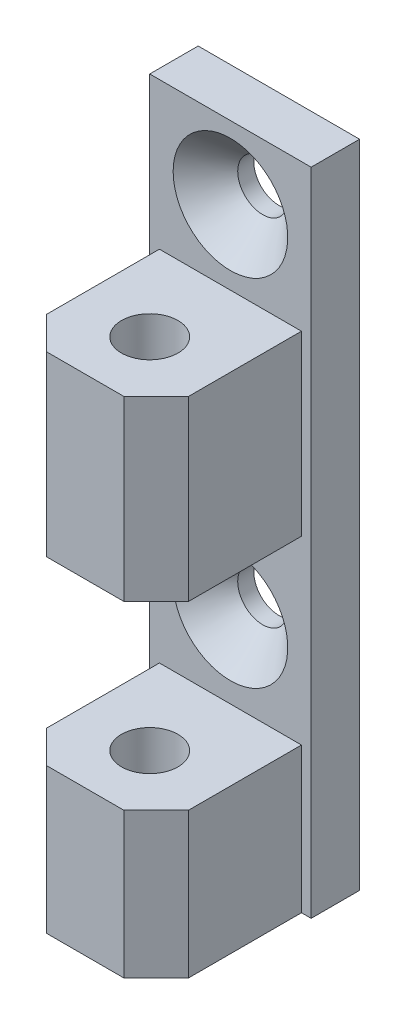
from build123d import *

# Parameters (mm, degrees)
ESQUISSE1_W             = 10
ESQUISSE1_H             = 12
EXTRUSION1_DEPTH        = 40.3
ESQUISSE2_R             = 1.75
ENL_V_MAT_EXTRU_1_DEPTH = 40.6
ESQUISSE3_W             = 10.281492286
ESQUISSE3_H             = 9.1
ESQUISSE3_H_2           = 11.2
ENL_V_MAT_EXTRU_2_DEPTH = 9
ESQUISSE4_R             = 1.55
ENL_V_MAT_EXTRU_3_DEPTH = 43.486350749
CHANFREIN1_SIZE         = 2


with BuildPart() as part:
    # Esquisse1 → Extrusion1 (new body)
    with BuildSketch(Plane(origin=(0, 0, 0), x_dir=(1, 0, 0), z_dir=(0, 1, 0))):
        with Locations((5, 6)):
            Rectangle(ESQUISSE1_W, ESQUISSE1_H)
    extrude(amount=EXTRUSION1_DEPTH)

    # Esquisse2 → Enl_v. mat.-Extru.1 (cut)
    with BuildSketch(Plane.XZ):
        with Locations(Location((5, -4, 0), (0, 0, 270))):
            Circle(ESQUISSE2_R)
        Polygon((0, -9), (0.6, -9), (0.6, -2), (2.6, 0), (0, 0), align=None)
        Polygon((10, -9), (9.4, -9), (9.4, -2), (7.4, 0), (10, 0), align=None)
    extrude(amount=-ENL_V_MAT_EXTRU_1_DEPTH, mode=Mode.SUBTRACT)

    # Esquisse3 → Enl_v. mat.-Extru.2 (cut)
    with BuildSketch(Plane.XY):
        with Locations((5.140746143, 35.75)):
            Rectangle(ESQUISSE3_W, ESQUISSE3_H)
        with Locations((5.140746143, 14.6)):
            Rectangle(ESQUISSE3_W, ESQUISSE3_H_2)
    extrude(amount=-ENL_V_MAT_EXTRU_2_DEPTH, mode=Mode.SUBTRACT)

    # Esquisse4 → Enl_v. mat.-Extru.3 (cut, through all)
    with BuildSketch(Plane.XY.offset(-9)):
        with Locations((5, 35.8)):
            Circle(ESQUISSE4_R)
        with Locations((5, 13.8)):
            Circle(ESQUISSE4_R)
    extrude(amount=-ENL_V_MAT_EXTRU_3_DEPTH, mode=Mode.SUBTRACT)

    # Chanfrein1
    chanfrein1_edges = [part.edges().sort_by_distance(p)[0] for p in [
        (3.45, 35.8, -9),
        (3.45, 13.8, -9),
    ]]
    chamfer(chanfrein1_edges, length=CHANFREIN1_SIZE)


solid = part.part
